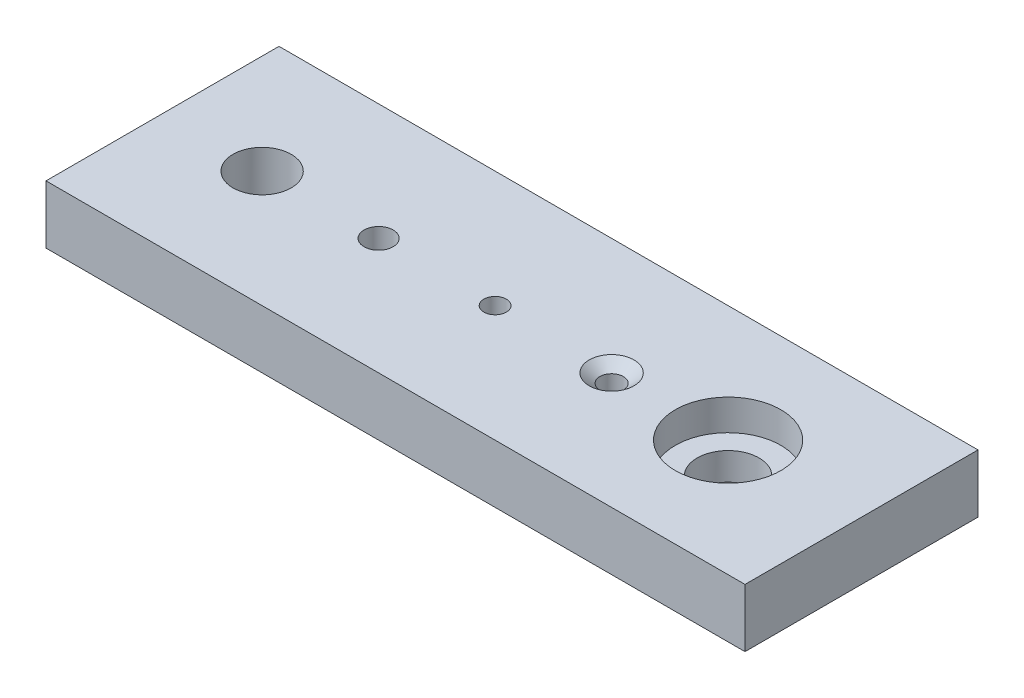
from build123d import *

# Parameters (mm, degrees)
SKETCH1_W                                          = 152.4
SKETCH1_H                                          = 50.8
BOSS_EXTRUDE1_DEPTH                                = 12.7
F_1_2_0_5_DIAMETER_HOLE1_D                         = 12.7
F_1_4_0_25_DIAMETER_HOLE1_D                        = 6.35
F_1_4_0_25_DIAMETER_HOLE1_DEPTH                    = 38.1
F_1_4_0_25_DIAMETER_HOLE1_TIP                      = 1.907732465
F_10_0_1935_DIAMETER_HOLE1_D                       = 4.9149
CSK_FOR_10_FLAT_HEAD_MACHINE_SCREW_100_D           = 5.1054
CSK_FOR_10_FLAT_HEAD_MACHINE_SCREW_100_CSINK_D     = 9.779
CSK_FOR_10_FLAT_HEAD_MACHINE_SCREW_100_CSINK_ANGLE = 100
CBORE_FOR_1_2_BUTTON_HEAD_CAP_SCREW1_D             = 13.49248
CBORE_FOR_1_2_BUTTON_HEAD_CAP_SCREW1_CBORE_D       = 23.01494
CBORE_FOR_1_2_BUTTON_HEAD_CAP_SCREW1_CBORE_DEPTH   = 6.731


with BuildPart() as part:
    # Sketch1 → Boss-Extrude1 (new body)
    with BuildSketch(Plane(origin=(0, 0, 0), x_dir=(1, 0, 0), z_dir=(0, 1, 0))):
        with Locations((76.2, 25.4)):
            Rectangle(SKETCH1_W, SKETCH1_H)
    extrude(amount=BOSS_EXTRUDE1_DEPTH)

    # 1_2 _0.5_ Diameter Hole1 (through all)
    with Locations(Plane(origin=(0, 12.7, 0), x_dir=(1, 0, 0), z_dir=(0, 1, 0))):
        with Locations((21.717, 25.4)):
            Hole(F_1_2_0_5_DIAMETER_HOLE1_D / 2)

    # 1_4 _0.25_ Diameter Hole1
    with Locations(Plane(origin=(0, 12.7, 0), x_dir=(1, 0, 0), z_dir=(0, 1, 0))):
        with Locations((47.117, 25.4)):
            Hole(F_1_4_0_25_DIAMETER_HOLE1_D / 2, depth=F_1_4_0_25_DIAMETER_HOLE1_DEPTH)
            with Locations((0, 0, -(F_1_4_0_25_DIAMETER_HOLE1_DEPTH + F_1_4_0_25_DIAMETER_HOLE1_TIP / 2))):  # 118° drill point
                Cone(0, F_1_4_0_25_DIAMETER_HOLE1_D / 2, F_1_4_0_25_DIAMETER_HOLE1_TIP, mode=Mode.SUBTRACT)

    # 10 _0.1935_ Diameter Hole1 (through all)
    with Locations(Plane(origin=(0, 12.7, 0), x_dir=(1, 0, 0), z_dir=(0, 1, 0))):
        with Locations((72.517, 25.4)):
            Hole(F_10_0_1935_DIAMETER_HOLE1_D / 2)

    # CSK for _10 Flat Head Machine Screw _100 (through all)
    with Locations(Plane(origin=(0, 12.7, 0), x_dir=(1, 0, 0), z_dir=(0, 1, 0))):
        with Locations((97.917, 25.4)):
            CounterSinkHole(CSK_FOR_10_FLAT_HEAD_MACHINE_SCREW_100_D / 2, CSK_FOR_10_FLAT_HEAD_MACHINE_SCREW_100_CSINK_D / 2, counter_sink_angle=CSK_FOR_10_FLAT_HEAD_MACHINE_SCREW_100_CSINK_ANGLE)

    # CBORE for 1_2 Button Head Cap Screw1 (through all)
    with Locations(Plane(origin=(0, 12.7, 0), x_dir=(1, 0, 0), z_dir=(0, 1, 0))):
        with Locations((123.317, 25.4)):
            CounterBoreHole(CBORE_FOR_1_2_BUTTON_HEAD_CAP_SCREW1_D / 2, CBORE_FOR_1_2_BUTTON_HEAD_CAP_SCREW1_CBORE_D / 2, CBORE_FOR_1_2_BUTTON_HEAD_CAP_SCREW1_CBORE_DEPTH)


solid = part.part
